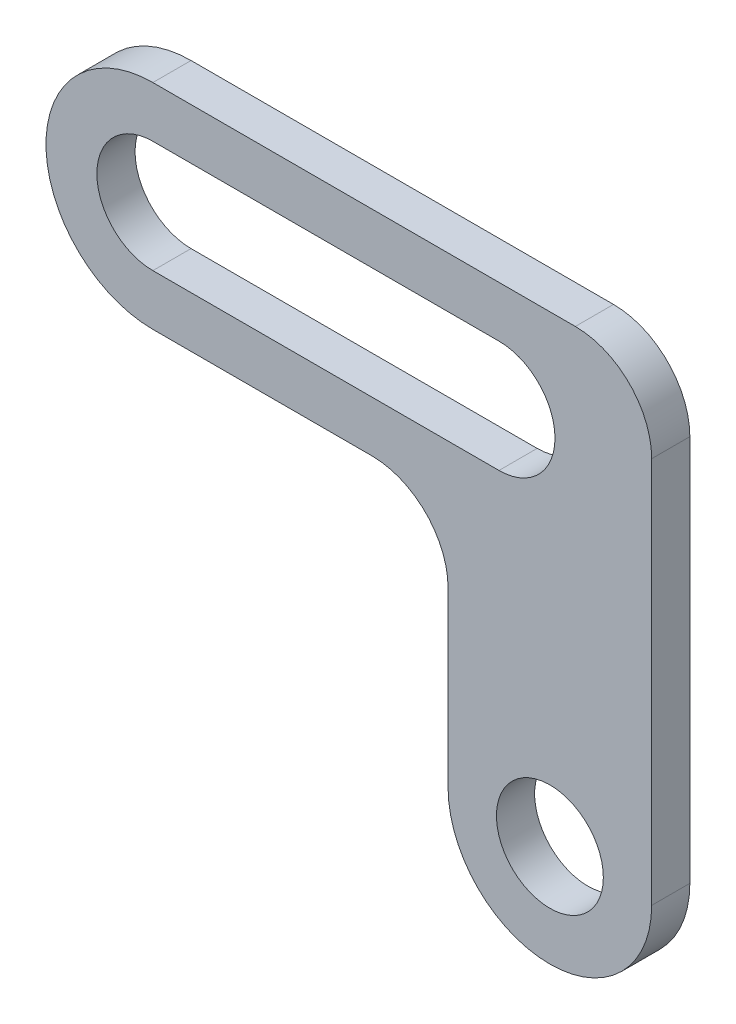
ISO-10303-21;
HEADER;
FILE_DESCRIPTION(('STEP AP214'),'2;1');
FILE_NAME('part.step','',(''),(''),'','','');
FILE_SCHEMA(('AUTOMOTIVE_DESIGN { 1 0 10303 214 1 1 1 1 }'));
ENDSEC;
DATA;
#1=APPLICATION_CONTEXT('core data for automotive mechanical design processes');
#2=APPLICATION_PROTOCOL_DEFINITION('international standard','automotive_design',2000,#1);
#3=PRODUCT_CONTEXT('',#1,'mechanical');
#4=PRODUCT('Part','Part','',(#3));
#5=PRODUCT_RELATED_PRODUCT_CATEGORY('part','',(#4));
#6=PRODUCT_DEFINITION_FORMATION('','',#4);
#7=PRODUCT_DEFINITION_CONTEXT('part definition',#1,'design');
#8=PRODUCT_DEFINITION('design','',#6,#7);
#9=PRODUCT_DEFINITION_SHAPE('','',#8);
#10=(LENGTH_UNIT() NAMED_UNIT(*) SI_UNIT(.MILLI.,.METRE.));
#11=(NAMED_UNIT(*) PLANE_ANGLE_UNIT() SI_UNIT($,.RADIAN.));
#12=(NAMED_UNIT(*) SI_UNIT($,.STERADIAN.) SOLID_ANGLE_UNIT());
#13=UNCERTAINTY_MEASURE_WITH_UNIT(LENGTH_MEASURE(1.E-05),#10,'distance_accuracy_value','');
#14=(GEOMETRIC_REPRESENTATION_CONTEXT(3) GLOBAL_UNCERTAINTY_ASSIGNED_CONTEXT((#13)) GLOBAL_UNIT_ASSIGNED_CONTEXT((#10,
#11,#12)) REPRESENTATION_CONTEXT('',''));
#15=CARTESIAN_POINT('',(0.,0.,0.));
#16=DIRECTION('',(0.,0.,1.));
#17=DIRECTION('',(1.,0.,0.));
#18=AXIS2_PLACEMENT_3D('',#15,#16,#17);
#19=CARTESIAN_POINT('',(0.,0.,15.));
#20=DIRECTION('',(0.,0.,1.));
#21=DIRECTION('',(1.,0.,0.));
#22=AXIS2_PLACEMENT_3D('',#19,#20,#21);
#23=PLANE('',#22);
#24=DIRECTION('',(1.,0.,0.));
#25=VECTOR('',#24,1.);
#26=CARTESIAN_POINT('',(-156.,118.,15.));
#27=LINE('',#26,#25);
#28=CARTESIAN_POINT('',(-156.,118.,15.));
#29=VERTEX_POINT('',#28);
#30=CARTESIAN_POINT('',(-20.,118.,15.));
#31=VERTEX_POINT('',#30);
#32=EDGE_CURVE('E132',#29,#31,#27,.T.);
#33=ORIENTED_EDGE('',*,*,#32,.F.);
#34=CARTESIAN_POINT('',(-156.,140.,15.));
#35=DIRECTION('',(0.,0.,1.));
#36=DIRECTION('',(1.,0.,0.));
#37=AXIS2_PLACEMENT_3D('',#34,#35,#36);
#38=CIRCLE('',#37,22.);
#39=CARTESIAN_POINT('',(-156.,162.,15.));
#40=VERTEX_POINT('',#39);
#41=EDGE_CURVE('E122',#40,#29,#38,.T.);
#42=ORIENTED_EDGE('',*,*,#41,.F.);
#43=DIRECTION('',(-1.,0.,0.));
#44=VECTOR('',#43,1.);
#45=CARTESIAN_POINT('',(-156.,162.,15.));
#46=LINE('',#45,#44);
#47=CARTESIAN_POINT('',(-20.,162.,15.));
#48=VERTEX_POINT('',#47);
#49=EDGE_CURVE('E148',#48,#40,#46,.T.);
#50=ORIENTED_EDGE('',*,*,#49,.F.);
#51=CARTESIAN_POINT('',(-20.,140.,15.));
#52=DIRECTION('',(0.,0.,1.));
#53=DIRECTION('',(1.,0.,0.));
#54=AXIS2_PLACEMENT_3D('',#51,#52,#53);
#55=CIRCLE('',#54,22.);
#56=EDGE_CURVE('E146',#31,#48,#55,.T.);
#57=ORIENTED_EDGE('',*,*,#56,.F.);
#58=EDGE_LOOP('',(#33,#42,#50,#57));
#59=FACE_BOUND('',#58,.T.);
#60=DIRECTION('',(0.,1.,0.));
#61=VECTOR('',#60,1.);
#62=CARTESIAN_POINT('',(40.,0.,15.));
#63=LINE('',#62,#61);
#64=CARTESIAN_POINT('',(40.,0.,15.));
#65=VERTEX_POINT('',#64);
#66=CARTESIAN_POINT('',(40.,152.,15.));
#67=VERTEX_POINT('',#66);
#68=EDGE_CURVE('E169',#65,#67,#63,.T.);
#69=ORIENTED_EDGE('',*,*,#68,.T.);
#70=CARTESIAN_POINT('',(9.99999999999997,152.,15.));
#71=DIRECTION('',(0.,0.,1.));
#72=DIRECTION('',(1.,0.,0.));
#73=AXIS2_PLACEMENT_3D('',#70,#71,#72);
#74=CIRCLE('',#73,30.);
#75=CARTESIAN_POINT('',(9.99999999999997,182.,15.));
#76=VERTEX_POINT('',#75);
#77=EDGE_CURVE('E215',#67,#76,#74,.T.);
#78=ORIENTED_EDGE('',*,*,#77,.T.);
#79=DIRECTION('',(-1.,0.,0.));
#80=VECTOR('',#79,1.);
#81=CARTESIAN_POINT('',(40.,182.,15.));
#82=LINE('',#81,#80);
#83=CARTESIAN_POINT('',(-156.,182.,15.));
#84=VERTEX_POINT('',#83);
#85=EDGE_CURVE('E172',#76,#84,#82,.T.);
#86=ORIENTED_EDGE('',*,*,#85,.T.);
#87=CARTESIAN_POINT('',(-156.,140.,15.));
#88=DIRECTION('',(0.,0.,1.));
#89=DIRECTION('',(1.,0.,0.));
#90=AXIS2_PLACEMENT_3D('',#87,#88,#89);
#91=CIRCLE('',#90,42.);
#92=CARTESIAN_POINT('',(-156.,98.,15.));
#93=VERTEX_POINT('',#92);
#94=EDGE_CURVE('E174',#84,#93,#91,.T.);
#95=ORIENTED_EDGE('',*,*,#94,.T.);
#96=DIRECTION('',(1.,0.,0.));
#97=VECTOR('',#96,1.);
#98=CARTESIAN_POINT('',(-156.,98.,15.));
#99=LINE('',#98,#97);
#100=CARTESIAN_POINT('',(-70.,98.,15.));
#101=VERTEX_POINT('',#100);
#102=EDGE_CURVE('E176',#93,#101,#99,.T.);
#103=ORIENTED_EDGE('',*,*,#102,.T.);
#104=CARTESIAN_POINT('',(-70.,68.,15.));
#105=DIRECTION('',(0.,0.,1.));
#106=DIRECTION('',(1.,0.,0.));
#107=AXIS2_PLACEMENT_3D('',#104,#105,#106);
#108=CIRCLE('',#107,30.);
#109=CARTESIAN_POINT('',(-40.,68.,15.));
#110=VERTEX_POINT('',#109);
#111=EDGE_CURVE('E11',#101,#110,#108,.F.);
#112=ORIENTED_EDGE('',*,*,#111,.T.);
#113=DIRECTION('',(0.,-1.,0.));
#114=VECTOR('',#113,1.);
#115=CARTESIAN_POINT('',(-40.,98.,15.));
#116=LINE('',#115,#114);
#117=CARTESIAN_POINT('',(-40.,0.,15.));
#118=VERTEX_POINT('',#117);
#119=EDGE_CURVE('E179',#110,#118,#116,.T.);
#120=ORIENTED_EDGE('',*,*,#119,.T.);
#121=CARTESIAN_POINT('',(0.,0.,15.));
#122=DIRECTION('',(0.,0.,1.));
#123=DIRECTION('',(1.,0.,0.));
#124=AXIS2_PLACEMENT_3D('',#121,#122,#123);
#125=CIRCLE('',#124,40.);
#126=EDGE_CURVE('E166',#118,#65,#125,.T.);
#127=ORIENTED_EDGE('',*,*,#126,.T.);
#128=EDGE_LOOP('',(#69,#78,#86,#95,#103,#112,#120,#127));
#129=FACE_BOUND('',#128,.T.);
#130=CARTESIAN_POINT('',(0.,0.,15.));
#131=DIRECTION('',(0.,0.,1.));
#132=DIRECTION('',(1.,0.,0.));
#133=AXIS2_PLACEMENT_3D('',#130,#131,#132);
#134=CIRCLE('',#133,21.);
#135=CARTESIAN_POINT('',(21.,0.,15.));
#136=VERTEX_POINT('',#135);
#137=EDGE_CURVE('E155',#136,#136,#134,.T.);
#138=ORIENTED_EDGE('',*,*,#137,.F.);
#139=EDGE_LOOP('',(#138));
#140=FACE_BOUND('',#139,.T.);
#141=ADVANCED_FACE('F33',(#59,#129,#140),#23,.T.);
#142=CARTESIAN_POINT('',(0.,0.,0.));
#143=DIRECTION('',(0.,0.,1.));
#144=DIRECTION('',(1.,0.,0.));
#145=AXIS2_PLACEMENT_3D('',#142,#143,#144);
#146=PLANE('',#145);
#147=DIRECTION('',(-1.,0.,0.));
#148=VECTOR('',#147,1.);
#149=CARTESIAN_POINT('',(40.,182.,0.));
#150=LINE('',#149,#148);
#151=CARTESIAN_POINT('',(9.99999999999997,182.,0.));
#152=VERTEX_POINT('',#151);
#153=CARTESIAN_POINT('',(-156.,182.,0.));
#154=VERTEX_POINT('',#153);
#155=EDGE_CURVE('E186',#152,#154,#150,.T.);
#156=ORIENTED_EDGE('',*,*,#155,.F.);
#157=CARTESIAN_POINT('',(9.99999999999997,152.,0.));
#158=DIRECTION('',(0.,0.,1.));
#159=DIRECTION('',(1.,0.,0.));
#160=AXIS2_PLACEMENT_3D('',#157,#158,#159);
#161=CIRCLE('',#160,30.);
#162=CARTESIAN_POINT('',(40.,152.,0.));
#163=VERTEX_POINT('',#162);
#164=EDGE_CURVE('E56',#152,#163,#161,.F.);
#165=ORIENTED_EDGE('',*,*,#164,.T.);
#166=DIRECTION('',(0.,1.,0.));
#167=VECTOR('',#166,1.);
#168=CARTESIAN_POINT('',(40.,0.,0.));
#169=LINE('',#168,#167);
#170=CARTESIAN_POINT('',(40.,0.,0.));
#171=VERTEX_POINT('',#170);
#172=EDGE_CURVE('E184',#171,#163,#169,.T.);
#173=ORIENTED_EDGE('',*,*,#172,.F.);
#174=CARTESIAN_POINT('',(0.,0.,0.));
#175=DIRECTION('',(0.,0.,1.));
#176=DIRECTION('',(1.,0.,0.));
#177=AXIS2_PLACEMENT_3D('',#174,#175,#176);
#178=CIRCLE('',#177,40.);
#179=CARTESIAN_POINT('',(-40.,0.,0.));
#180=VERTEX_POINT('',#179);
#181=EDGE_CURVE('E140',#180,#171,#178,.T.);
#182=ORIENTED_EDGE('',*,*,#181,.F.);
#183=DIRECTION('',(0.,-1.,0.));
#184=VECTOR('',#183,1.);
#185=CARTESIAN_POINT('',(-40.,98.,0.));
#186=LINE('',#185,#184);
#187=CARTESIAN_POINT('',(-40.,68.,0.));
#188=VERTEX_POINT('',#187);
#189=EDGE_CURVE('E170',#188,#180,#186,.T.);
#190=ORIENTED_EDGE('',*,*,#189,.F.);
#191=CARTESIAN_POINT('',(-70.,68.,0.));
#192=DIRECTION('',(0.,0.,1.));
#193=DIRECTION('',(1.,0.,0.));
#194=AXIS2_PLACEMENT_3D('',#191,#192,#193);
#195=CIRCLE('',#194,30.);
#196=CARTESIAN_POINT('',(-70.,98.,0.));
#197=VERTEX_POINT('',#196);
#198=EDGE_CURVE('E41',#188,#197,#195,.T.);
#199=ORIENTED_EDGE('',*,*,#198,.T.);
#200=DIRECTION('',(1.,0.,0.));
#201=VECTOR('',#200,1.);
#202=CARTESIAN_POINT('',(-156.,98.,0.));
#203=LINE('',#202,#201);
#204=CARTESIAN_POINT('',(-156.,98.,0.));
#205=VERTEX_POINT('',#204);
#206=EDGE_CURVE('E190',#205,#197,#203,.T.);
#207=ORIENTED_EDGE('',*,*,#206,.F.);
#208=CARTESIAN_POINT('',(-156.,140.,0.));
#209=DIRECTION('',(0.,0.,1.));
#210=DIRECTION('',(1.,0.,0.));
#211=AXIS2_PLACEMENT_3D('',#208,#209,#210);
#212=CIRCLE('',#211,42.);
#213=EDGE_CURVE('E188',#154,#205,#212,.T.);
#214=ORIENTED_EDGE('',*,*,#213,.F.);
#215=EDGE_LOOP('',(#156,#165,#173,#182,#190,#199,#207,#214));
#216=FACE_BOUND('',#215,.T.);
#217=CARTESIAN_POINT('',(-156.,140.,0.));
#218=DIRECTION('',(0.,0.,1.));
#219=DIRECTION('',(1.,0.,0.));
#220=AXIS2_PLACEMENT_3D('',#217,#218,#219);
#221=CIRCLE('',#220,22.);
#222=CARTESIAN_POINT('',(-156.,162.,0.));
#223=VERTEX_POINT('',#222);
#224=CARTESIAN_POINT('',(-156.,118.,0.));
#225=VERTEX_POINT('',#224);
#226=EDGE_CURVE('E153',#223,#225,#221,.T.);
#227=ORIENTED_EDGE('',*,*,#226,.T.);
#228=DIRECTION('',(1.,0.,0.));
#229=VECTOR('',#228,1.);
#230=CARTESIAN_POINT('',(-156.,118.,0.));
#231=LINE('',#230,#229);
#232=CARTESIAN_POINT('',(-20.,118.,0.));
#233=VERTEX_POINT('',#232);
#234=EDGE_CURVE('E139',#225,#233,#231,.T.);
#235=ORIENTED_EDGE('',*,*,#234,.T.);
#236=CARTESIAN_POINT('',(-20.,140.,0.));
#237=DIRECTION('',(0.,0.,1.));
#238=DIRECTION('',(1.,0.,0.));
#239=AXIS2_PLACEMENT_3D('',#236,#237,#238);
#240=CIRCLE('',#239,22.);
#241=CARTESIAN_POINT('',(-20.,162.,0.));
#242=VERTEX_POINT('',#241);
#243=EDGE_CURVE('E157',#233,#242,#240,.T.);
#244=ORIENTED_EDGE('',*,*,#243,.T.);
#245=DIRECTION('',(-1.,0.,0.));
#246=VECTOR('',#245,1.);
#247=CARTESIAN_POINT('',(-156.,162.,0.));
#248=LINE('',#247,#246);
#249=EDGE_CURVE('E133',#242,#223,#248,.T.);
#250=ORIENTED_EDGE('',*,*,#249,.T.);
#251=EDGE_LOOP('',(#227,#235,#244,#250));
#252=FACE_BOUND('',#251,.T.);
#253=CARTESIAN_POINT('',(0.,0.,0.));
#254=DIRECTION('',(0.,0.,1.));
#255=DIRECTION('',(1.,0.,0.));
#256=AXIS2_PLACEMENT_3D('',#253,#254,#255);
#257=CIRCLE('',#256,21.);
#258=CARTESIAN_POINT('',(21.,0.,0.));
#259=VERTEX_POINT('',#258);
#260=EDGE_CURVE('E297',#259,#259,#257,.T.);
#261=ORIENTED_EDGE('',*,*,#260,.T.);
#262=EDGE_LOOP('',(#261));
#263=FACE_BOUND('',#262,.T.);
#264=ADVANCED_FACE('F218',(#216,#252,#263),#146,.F.);
#265=CARTESIAN_POINT('',(0.,0.,15.));
#266=DIRECTION('',(0.,0.,-1.));
#267=DIRECTION('',(-1.,0.,0.));
#268=AXIS2_PLACEMENT_3D('',#265,#266,#267);
#269=CYLINDRICAL_SURFACE('',#268,40.);
#270=ORIENTED_EDGE('',*,*,#181,.T.);
#271=DIRECTION('',(0.,0.,-1.));
#272=VECTOR('',#271,1.);
#273=CARTESIAN_POINT('',(40.,0.,15.));
#274=LINE('',#273,#272);
#275=EDGE_CURVE('E202',#65,#171,#274,.T.);
#276=ORIENTED_EDGE('',*,*,#275,.F.);
#277=ORIENTED_EDGE('',*,*,#126,.F.);
#278=DIRECTION('',(0.,0.,-1.));
#279=VECTOR('',#278,1.);
#280=CARTESIAN_POINT('',(-40.,0.,15.));
#281=LINE('',#280,#279);
#282=EDGE_CURVE('E181',#118,#180,#281,.T.);
#283=ORIENTED_EDGE('',*,*,#282,.T.);
#284=EDGE_LOOP('',(#270,#276,#277,#283));
#285=FACE_BOUND('',#284,.T.);
#286=ADVANCED_FACE('F239',(#285),#269,.T.);
#287=CARTESIAN_POINT('',(40.,0.,15.));
#288=DIRECTION('',(-1.,0.,0.));
#289=DIRECTION('',(0.,-1.,0.));
#290=AXIS2_PLACEMENT_3D('',#287,#288,#289);
#291=PLANE('',#290);
#292=ORIENTED_EDGE('',*,*,#172,.T.);
#293=DIRECTION('',(0.,0.,-1.));
#294=VECTOR('',#293,1.);
#295=CARTESIAN_POINT('',(40.,152.,15.));
#296=LINE('',#295,#294);
#297=EDGE_CURVE('E48',#163,#67,#296,.F.);
#298=ORIENTED_EDGE('',*,*,#297,.T.);
#299=ORIENTED_EDGE('',*,*,#68,.F.);
#300=ORIENTED_EDGE('',*,*,#275,.T.);
#301=EDGE_LOOP('',(#292,#298,#299,#300));
#302=FACE_BOUND('',#301,.T.);
#303=ADVANCED_FACE('F257',(#302),#291,.F.);
#304=CARTESIAN_POINT('',(40.,182.,15.));
#305=DIRECTION('',(0.,-1.,0.));
#306=DIRECTION('',(0.,0.,-1.));
#307=AXIS2_PLACEMENT_3D('',#304,#305,#306);
#308=PLANE('',#307);
#309=ORIENTED_EDGE('',*,*,#85,.F.);
#310=DIRECTION('',(0.,0.,-1.));
#311=VECTOR('',#310,1.);
#312=CARTESIAN_POINT('',(9.99999999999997,182.,15.));
#313=LINE('',#312,#311);
#314=EDGE_CURVE('E210',#76,#152,#313,.T.);
#315=ORIENTED_EDGE('',*,*,#314,.T.);
#316=ORIENTED_EDGE('',*,*,#155,.T.);
#317=DIRECTION('',(0.,0.,-1.));
#318=VECTOR('',#317,1.);
#319=CARTESIAN_POINT('',(-156.,182.,15.));
#320=LINE('',#319,#318);
#321=EDGE_CURVE('E199',#84,#154,#320,.T.);
#322=ORIENTED_EDGE('',*,*,#321,.F.);
#323=EDGE_LOOP('',(#309,#315,#316,#322));
#324=FACE_BOUND('',#323,.T.);
#325=ADVANCED_FACE('F245',(#324),#308,.F.);
#326=CARTESIAN_POINT('',(-156.,140.,15.));
#327=DIRECTION('',(0.,0.,-1.));
#328=DIRECTION('',(-1.,0.,0.));
#329=AXIS2_PLACEMENT_3D('',#326,#327,#328);
#330=CYLINDRICAL_SURFACE('',#329,42.);
#331=ORIENTED_EDGE('',*,*,#213,.T.);
#332=DIRECTION('',(0.,0.,-1.));
#333=VECTOR('',#332,1.);
#334=CARTESIAN_POINT('',(-156.,98.,15.));
#335=LINE('',#334,#333);
#336=EDGE_CURVE('E196',#93,#205,#335,.T.);
#337=ORIENTED_EDGE('',*,*,#336,.F.);
#338=ORIENTED_EDGE('',*,*,#94,.F.);
#339=ORIENTED_EDGE('',*,*,#321,.T.);
#340=EDGE_LOOP('',(#331,#337,#338,#339));
#341=FACE_BOUND('',#340,.T.);
#342=ADVANCED_FACE('F248',(#341),#330,.T.);
#343=CARTESIAN_POINT('',(-156.,98.,15.));
#344=DIRECTION('',(0.,1.,0.));
#345=DIRECTION('',(0.,0.,1.));
#346=AXIS2_PLACEMENT_3D('',#343,#344,#345);
#347=PLANE('',#346);
#348=ORIENTED_EDGE('',*,*,#206,.T.);
#349=DIRECTION('',(0.,0.,-1.));
#350=VECTOR('',#349,1.);
#351=CARTESIAN_POINT('',(-70.,98.,15.));
#352=LINE('',#351,#350);
#353=EDGE_CURVE('E208',#197,#101,#352,.F.);
#354=ORIENTED_EDGE('',*,*,#353,.T.);
#355=ORIENTED_EDGE('',*,*,#102,.F.);
#356=ORIENTED_EDGE('',*,*,#336,.T.);
#357=EDGE_LOOP('',(#348,#354,#355,#356));
#358=FACE_BOUND('',#357,.T.);
#359=ADVANCED_FACE('F226',(#358),#347,.F.);
#360=CARTESIAN_POINT('',(-40.,98.,15.));
#361=DIRECTION('',(1.,0.,0.));
#362=DIRECTION('',(0.,0.,-1.));
#363=AXIS2_PLACEMENT_3D('',#360,#361,#362);
#364=PLANE('',#363);
#365=ORIENTED_EDGE('',*,*,#119,.F.);
#366=DIRECTION('',(0.,0.,-1.));
#367=VECTOR('',#366,1.);
#368=CARTESIAN_POINT('',(-40.,68.,0.));
#369=LINE('',#368,#367);
#370=EDGE_CURVE('E205',#110,#188,#369,.T.);
#371=ORIENTED_EDGE('',*,*,#370,.T.);
#372=ORIENTED_EDGE('',*,*,#189,.T.);
#373=ORIENTED_EDGE('',*,*,#282,.F.);
#374=EDGE_LOOP('',(#365,#371,#372,#373));
#375=FACE_BOUND('',#374,.T.);
#376=ADVANCED_FACE('F235',(#375),#364,.F.);
#377=CARTESIAN_POINT('',(-156.,140.,15.));
#378=DIRECTION('',(0.,0.,-1.));
#379=DIRECTION('',(-1.,0.,0.));
#380=AXIS2_PLACEMENT_3D('',#377,#378,#379);
#381=CYLINDRICAL_SURFACE('',#380,22.);
#382=ORIENTED_EDGE('',*,*,#226,.F.);
#383=DIRECTION('',(0.,0.,-1.));
#384=VECTOR('',#383,1.);
#385=CARTESIAN_POINT('',(-156.,162.,15.));
#386=LINE('',#385,#384);
#387=EDGE_CURVE('E128',#40,#223,#386,.T.);
#388=ORIENTED_EDGE('',*,*,#387,.F.);
#389=ORIENTED_EDGE('',*,*,#41,.T.);
#390=DIRECTION('',(0.,0.,-1.));
#391=VECTOR('',#390,1.);
#392=CARTESIAN_POINT('',(-156.,118.,15.));
#393=LINE('',#392,#391);
#394=EDGE_CURVE('E125',#29,#225,#393,.T.);
#395=ORIENTED_EDGE('',*,*,#394,.T.);
#396=EDGE_LOOP('',(#382,#388,#389,#395));
#397=FACE_BOUND('',#396,.T.);
#398=ADVANCED_FACE('F124',(#397),#381,.F.);
#399=CARTESIAN_POINT('',(-156.,118.,15.));
#400=DIRECTION('',(0.,1.,0.));
#401=DIRECTION('',(0.,0.,1.));
#402=AXIS2_PLACEMENT_3D('',#399,#400,#401);
#403=PLANE('',#402);
#404=ORIENTED_EDGE('',*,*,#234,.F.);
#405=ORIENTED_EDGE('',*,*,#394,.F.);
#406=ORIENTED_EDGE('',*,*,#32,.T.);
#407=DIRECTION('',(0.,0.,-1.));
#408=VECTOR('',#407,1.);
#409=CARTESIAN_POINT('',(-20.,118.,15.));
#410=LINE('',#409,#408);
#411=EDGE_CURVE('E141',#31,#233,#410,.T.);
#412=ORIENTED_EDGE('',*,*,#411,.T.);
#413=EDGE_LOOP('',(#404,#405,#406,#412));
#414=FACE_BOUND('',#413,.T.);
#415=ADVANCED_FACE('F136',(#414),#403,.T.);
#416=CARTESIAN_POINT('',(-20.,140.,15.));
#417=DIRECTION('',(0.,0.,-1.));
#418=DIRECTION('',(-1.,0.,0.));
#419=AXIS2_PLACEMENT_3D('',#416,#417,#418);
#420=CYLINDRICAL_SURFACE('',#419,22.);
#421=ORIENTED_EDGE('',*,*,#243,.F.);
#422=ORIENTED_EDGE('',*,*,#411,.F.);
#423=ORIENTED_EDGE('',*,*,#56,.T.);
#424=DIRECTION('',(0.,0.,-1.));
#425=VECTOR('',#424,1.);
#426=CARTESIAN_POINT('',(-20.,162.,15.));
#427=LINE('',#426,#425);
#428=EDGE_CURVE('E163',#48,#242,#427,.T.);
#429=ORIENTED_EDGE('',*,*,#428,.T.);
#430=EDGE_LOOP('',(#421,#422,#423,#429));
#431=FACE_BOUND('',#430,.T.);
#432=ADVANCED_FACE('F275',(#431),#420,.F.);
#433=CARTESIAN_POINT('',(-156.,162.,15.));
#434=DIRECTION('',(0.,-1.,0.));
#435=DIRECTION('',(0.,0.,-1.));
#436=AXIS2_PLACEMENT_3D('',#433,#434,#435);
#437=PLANE('',#436);
#438=ORIENTED_EDGE('',*,*,#249,.F.);
#439=ORIENTED_EDGE('',*,*,#428,.F.);
#440=ORIENTED_EDGE('',*,*,#49,.T.);
#441=ORIENTED_EDGE('',*,*,#387,.T.);
#442=EDGE_LOOP('',(#438,#439,#440,#441));
#443=FACE_BOUND('',#442,.T.);
#444=ADVANCED_FACE('F279',(#443),#437,.T.);
#445=CARTESIAN_POINT('',(0.,0.,15.));
#446=DIRECTION('',(0.,0.,-1.));
#447=DIRECTION('',(-1.,0.,0.));
#448=AXIS2_PLACEMENT_3D('',#445,#446,#447);
#449=CYLINDRICAL_SURFACE('',#448,21.);
#450=ORIENTED_EDGE('',*,*,#137,.T.);
#451=EDGE_LOOP('',(#450));
#452=FACE_BOUND('',#451,.T.);
#453=ORIENTED_EDGE('',*,*,#260,.F.);
#454=EDGE_LOOP('',(#453));
#455=FACE_BOUND('',#454,.T.);
#456=ADVANCED_FACE('F285',(#452,#455),#449,.F.);
#457=CARTESIAN_POINT('',(-70.,68.,15.));
#458=DIRECTION('',(0.,0.,1.));
#459=DIRECTION('',(1.,0.,0.));
#460=AXIS2_PLACEMENT_3D('',#457,#458,#459);
#461=CYLINDRICAL_SURFACE('',#460,30.);
#462=ORIENTED_EDGE('',*,*,#111,.F.);
#463=ORIENTED_EDGE('',*,*,#353,.F.);
#464=ORIENTED_EDGE('',*,*,#198,.F.);
#465=ORIENTED_EDGE('',*,*,#370,.F.);
#466=EDGE_LOOP('',(#462,#463,#464,#465));
#467=FACE_BOUND('',#466,.T.);
#468=ADVANCED_FACE('F230',(#467),#461,.F.);
#469=CARTESIAN_POINT('',(9.99999999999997,152.,15.));
#470=DIRECTION('',(0.,0.,-1.));
#471=DIRECTION('',(-1.,0.,0.));
#472=AXIS2_PLACEMENT_3D('',#469,#470,#471);
#473=CYLINDRICAL_SURFACE('',#472,30.);
#474=ORIENTED_EDGE('',*,*,#77,.F.);
#475=ORIENTED_EDGE('',*,*,#297,.F.);
#476=ORIENTED_EDGE('',*,*,#164,.F.);
#477=ORIENTED_EDGE('',*,*,#314,.F.);
#478=EDGE_LOOP('',(#474,#475,#476,#477));
#479=FACE_BOUND('',#478,.T.);
#480=ADVANCED_FACE('F35',(#479),#473,.T.);
#481=CLOSED_SHELL('',(#141,#264,#286,#303,#325,#342,#359,#376,#398,#415,#432,#444,#456,#468,#480));
#482=MANIFOLD_SOLID_BREP('B2',#481);
#483=ADVANCED_BREP_SHAPE_REPRESENTATION('',(#18,#482),#14);
#484=SHAPE_DEFINITION_REPRESENTATION(#9,#483);
ENDSEC;
END-ISO-10303-21;
